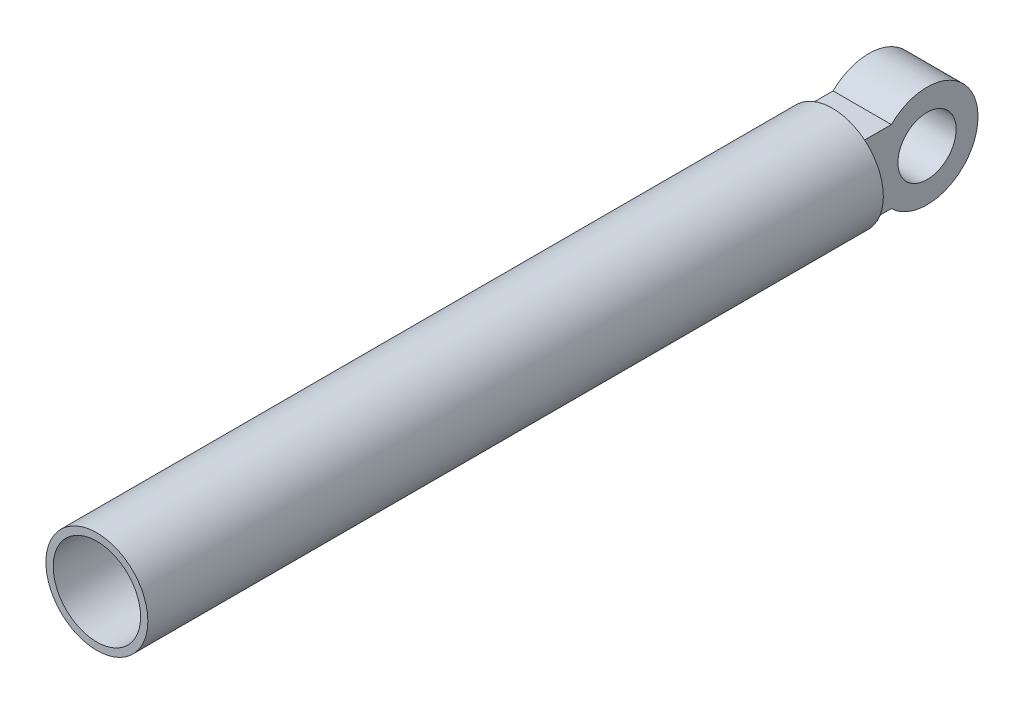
ISO-10303-21;
HEADER;
FILE_DESCRIPTION(('STEP AP214'),'2;1');
FILE_NAME('part.step','',(''),(''),'','','');
FILE_SCHEMA(('AUTOMOTIVE_DESIGN { 1 0 10303 214 1 1 1 1 }'));
ENDSEC;
DATA;
#1=APPLICATION_CONTEXT('core data for automotive mechanical design processes');
#2=APPLICATION_PROTOCOL_DEFINITION('international standard','automotive_design',2000,#1);
#3=PRODUCT_CONTEXT('',#1,'mechanical');
#4=PRODUCT('Part','Part','',(#3));
#5=PRODUCT_RELATED_PRODUCT_CATEGORY('part','',(#4));
#6=PRODUCT_DEFINITION_FORMATION('','',#4);
#7=PRODUCT_DEFINITION_CONTEXT('part definition',#1,'design');
#8=PRODUCT_DEFINITION('design','',#6,#7);
#9=PRODUCT_DEFINITION_SHAPE('','',#8);
#10=(LENGTH_UNIT() NAMED_UNIT(*) SI_UNIT(.MILLI.,.METRE.));
#11=(NAMED_UNIT(*) PLANE_ANGLE_UNIT() SI_UNIT($,.RADIAN.));
#12=(NAMED_UNIT(*) SI_UNIT($,.STERADIAN.) SOLID_ANGLE_UNIT());
#13=UNCERTAINTY_MEASURE_WITH_UNIT(LENGTH_MEASURE(1.E-05),#10,'distance_accuracy_value','');
#14=(GEOMETRIC_REPRESENTATION_CONTEXT(3) GLOBAL_UNCERTAINTY_ASSIGNED_CONTEXT((#13)) GLOBAL_UNIT_ASSIGNED_CONTEXT((#10,
#11,#12)) REPRESENTATION_CONTEXT('',''));
#15=CARTESIAN_POINT('',(0.,0.,0.));
#16=DIRECTION('',(0.,0.,1.));
#17=DIRECTION('',(1.,0.,0.));
#18=AXIS2_PLACEMENT_3D('',#15,#16,#17);
#19=CARTESIAN_POINT('',(0.,0.,-5.));
#20=DIRECTION('',(0.,0.,1.));
#21=DIRECTION('',(1.,0.,0.));
#22=AXIS2_PLACEMENT_3D('',#19,#20,#21);
#23=PLANE('',#22);
#24=CARTESIAN_POINT('',(0.,0.,-5.));
#25=DIRECTION('',(0.,0.,1.));
#26=DIRECTION('',(1.,0.,0.));
#27=AXIS2_PLACEMENT_3D('',#24,#25,#26);
#28=CIRCLE('',#27,35.);
#29=CARTESIAN_POINT('',(35.,0.,-5.));
#30=VERTEX_POINT('',#29);
#31=EDGE_CURVE('E39',#30,#30,#28,.T.);
#32=ORIENTED_EDGE('',*,*,#31,.F.);
#33=EDGE_LOOP('',(#32));
#34=FACE_BOUND('',#33,.T.);
#35=DIRECTION('',(-1.,0.,0.));
#36=VECTOR('',#35,1.);
#37=CARTESIAN_POINT('',(20.,-25.,-5.00000000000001));
#38=LINE('',#37,#36);
#39=CARTESIAN_POINT('',(20.,-25.,-5.));
#40=VERTEX_POINT('',#39);
#41=CARTESIAN_POINT('',(-20.,-25.,-5.));
#42=VERTEX_POINT('',#41);
#43=EDGE_CURVE('E46',#40,#42,#38,.T.);
#44=ORIENTED_EDGE('',*,*,#43,.F.);
#45=DIRECTION('',(0.,-1.,0.));
#46=VECTOR('',#45,1.);
#47=CARTESIAN_POINT('',(20.,25.,-5.00000000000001));
#48=LINE('',#47,#46);
#49=CARTESIAN_POINT('',(20.,25.,-5.00000000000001));
#50=VERTEX_POINT('',#49);
#51=EDGE_CURVE('E78',#50,#40,#48,.T.);
#52=ORIENTED_EDGE('',*,*,#51,.F.);
#53=DIRECTION('',(-1.,0.,0.));
#54=VECTOR('',#53,1.);
#55=CARTESIAN_POINT('',(20.,25.,-5.00000000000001));
#56=LINE('',#55,#54);
#57=CARTESIAN_POINT('',(-20.,25.,-5.));
#58=VERTEX_POINT('',#57);
#59=EDGE_CURVE('E94',#50,#58,#56,.T.);
#60=ORIENTED_EDGE('',*,*,#59,.T.);
#61=DIRECTION('',(0.,-1.,0.));
#62=VECTOR('',#61,1.);
#63=CARTESIAN_POINT('',(-20.,25.,-5.00000000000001));
#64=LINE('',#63,#62);
#65=EDGE_CURVE('E51',#58,#42,#64,.T.);
#66=ORIENTED_EDGE('',*,*,#65,.T.);
#67=EDGE_LOOP('',(#44,#52,#60,#66));
#68=FACE_BOUND('',#67,.T.);
#69=ADVANCED_FACE('F32',(#34,#68),#23,.F.);
#70=CARTESIAN_POINT('',(0.,0.,500.));
#71=DIRECTION('',(0.,0.,-1.));
#72=DIRECTION('',(-1.,0.,0.));
#73=AXIS2_PLACEMENT_3D('',#70,#71,#72);
#74=CYLINDRICAL_SURFACE('',#73,35.);
#75=CARTESIAN_POINT('',(0.,0.,500.));
#76=DIRECTION('',(0.,0.,1.));
#77=DIRECTION('',(1.,0.,0.));
#78=AXIS2_PLACEMENT_3D('',#75,#76,#77);
#79=CIRCLE('',#78,35.);
#80=CARTESIAN_POINT('',(35.,0.,500.));
#81=VERTEX_POINT('',#80);
#82=EDGE_CURVE('E11',#81,#81,#79,.T.);
#83=ORIENTED_EDGE('',*,*,#82,.F.);
#84=EDGE_LOOP('',(#83));
#85=FACE_BOUND('',#84,.T.);
#86=ORIENTED_EDGE('',*,*,#31,.T.);
#87=EDGE_LOOP('',(#86));
#88=FACE_BOUND('',#87,.T.);
#89=ADVANCED_FACE('F117',(#85,#88),#74,.T.);
#90=CARTESIAN_POINT('',(0.,0.,500.));
#91=DIRECTION('',(0.,0.,1.));
#92=DIRECTION('',(1.,0.,0.));
#93=AXIS2_PLACEMENT_3D('',#90,#91,#92);
#94=PLANE('',#93);
#95=CARTESIAN_POINT('',(0.,0.,500.));
#96=DIRECTION('',(0.,0.,1.));
#97=DIRECTION('',(1.,0.,0.));
#98=AXIS2_PLACEMENT_3D('',#95,#96,#97);
#99=CIRCLE('',#98,30.);
#100=CARTESIAN_POINT('',(30.,0.,500.));
#101=VERTEX_POINT('',#100);
#102=EDGE_CURVE('E110',#101,#101,#99,.T.);
#103=ORIENTED_EDGE('',*,*,#102,.F.);
#104=EDGE_LOOP('',(#103));
#105=FACE_BOUND('',#104,.T.);
#106=ORIENTED_EDGE('',*,*,#82,.T.);
#107=EDGE_LOOP('',(#106));
#108=FACE_BOUND('',#107,.T.);
#109=ADVANCED_FACE('F123',(#105,#108),#94,.T.);
#110=CARTESIAN_POINT('',(0.,0.,500.));
#111=DIRECTION('',(0.,0.,-1.));
#112=DIRECTION('',(-1.,0.,0.));
#113=AXIS2_PLACEMENT_3D('',#110,#111,#112);
#114=CYLINDRICAL_SURFACE('',#113,30.);
#115=ORIENTED_EDGE('',*,*,#102,.T.);
#116=EDGE_LOOP('',(#115));
#117=FACE_BOUND('',#116,.T.);
#118=CARTESIAN_POINT('',(0.,0.,0.));
#119=DIRECTION('',(0.,0.,1.));
#120=DIRECTION('',(1.,0.,0.));
#121=AXIS2_PLACEMENT_3D('',#118,#119,#120);
#122=CIRCLE('',#121,30.);
#123=CARTESIAN_POINT('',(30.,0.,0.));
#124=VERTEX_POINT('',#123);
#125=EDGE_CURVE('E109',#124,#124,#122,.T.);
#126=ORIENTED_EDGE('',*,*,#125,.F.);
#127=EDGE_LOOP('',(#126));
#128=FACE_BOUND('',#127,.T.);
#129=ADVANCED_FACE('F128',(#117,#128),#114,.F.);
#130=CARTESIAN_POINT('',(0.,0.,0.));
#131=DIRECTION('',(0.,0.,1.));
#132=DIRECTION('',(1.,0.,0.));
#133=AXIS2_PLACEMENT_3D('',#130,#131,#132);
#134=PLANE('',#133);
#135=ORIENTED_EDGE('',*,*,#125,.T.);
#136=EDGE_LOOP('',(#135));
#137=FACE_BOUND('',#136,.T.);
#138=ADVANCED_FACE('F135',(#137),#134,.T.);
#139=CARTESIAN_POINT('',(20.,0.,-50.));
#140=DIRECTION('',(1.,0.,0.));
#141=DIRECTION('',(0.,0.,-1.));
#142=AXIS2_PLACEMENT_3D('',#139,#140,#141);
#143=PLANE('',#142);
#144=ORIENTED_EDGE('',*,*,#51,.T.);
#145=DIRECTION('',(0.,0.,-1.));
#146=VECTOR('',#145,1.);
#147=CARTESIAN_POINT('',(20.,-25.,-5.00000000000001));
#148=LINE('',#147,#146);
#149=CARTESIAN_POINT('',(20.,-25.,-25.5051025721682));
#150=VERTEX_POINT('',#149);
#151=EDGE_CURVE('E70',#40,#150,#148,.T.);
#152=ORIENTED_EDGE('',*,*,#151,.T.);
#153=CARTESIAN_POINT('',(20.,0.,-50.));
#154=DIRECTION('',(1.,0.,0.));
#155=DIRECTION('',(0.,0.,-1.));
#156=AXIS2_PLACEMENT_3D('',#153,#154,#155);
#157=CIRCLE('',#156,35.);
#158=CARTESIAN_POINT('',(20.,25.,-25.5051025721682));
#159=VERTEX_POINT('',#158);
#160=EDGE_CURVE('E76',#150,#159,#157,.T.);
#161=ORIENTED_EDGE('',*,*,#160,.T.);
#162=DIRECTION('',(0.,0.,1.));
#163=VECTOR('',#162,1.);
#164=CARTESIAN_POINT('',(20.,25.,-5.00000000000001));
#165=LINE('',#164,#163);
#166=EDGE_CURVE('E92',#159,#50,#165,.T.);
#167=ORIENTED_EDGE('',*,*,#166,.T.);
#168=EDGE_LOOP('',(#144,#152,#161,#167));
#169=FACE_BOUND('',#168,.T.);
#170=CARTESIAN_POINT('',(20.,0.,-50.));
#171=DIRECTION('',(1.,0.,0.));
#172=DIRECTION('',(0.,0.,-1.));
#173=AXIS2_PLACEMENT_3D('',#170,#171,#172);
#174=CIRCLE('',#173,20.);
#175=CARTESIAN_POINT('',(20.,0.,-70.));
#176=VERTEX_POINT('',#175);
#177=EDGE_CURVE('E99',#176,#176,#174,.T.);
#178=ORIENTED_EDGE('',*,*,#177,.F.);
#179=EDGE_LOOP('',(#178));
#180=FACE_BOUND('',#179,.T.);
#181=ADVANCED_FACE('F72',(#169,#180),#143,.T.);
#182=CARTESIAN_POINT('',(-20.,0.,-50.));
#183=DIRECTION('',(1.,0.,0.));
#184=DIRECTION('',(0.,0.,-1.));
#185=AXIS2_PLACEMENT_3D('',#182,#183,#184);
#186=PLANE('',#185);
#187=ORIENTED_EDGE('',*,*,#65,.F.);
#188=DIRECTION('',(0.,0.,1.));
#189=VECTOR('',#188,1.);
#190=CARTESIAN_POINT('',(-20.,25.,-5.00000000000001));
#191=LINE('',#190,#189);
#192=CARTESIAN_POINT('',(-20.,25.,-25.5051025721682));
#193=VERTEX_POINT('',#192);
#194=EDGE_CURVE('E103',#193,#58,#191,.T.);
#195=ORIENTED_EDGE('',*,*,#194,.F.);
#196=CARTESIAN_POINT('',(-20.,0.,-50.));
#197=DIRECTION('',(1.,0.,0.));
#198=DIRECTION('',(0.,0.,-1.));
#199=AXIS2_PLACEMENT_3D('',#196,#197,#198);
#200=CIRCLE('',#199,35.);
#201=CARTESIAN_POINT('',(-20.,-25.,-25.5051025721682));
#202=VERTEX_POINT('',#201);
#203=EDGE_CURVE('E101',#202,#193,#200,.T.);
#204=ORIENTED_EDGE('',*,*,#203,.F.);
#205=DIRECTION('',(0.,0.,-1.));
#206=VECTOR('',#205,1.);
#207=CARTESIAN_POINT('',(-20.,-25.,-5.00000000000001));
#208=LINE('',#207,#206);
#209=EDGE_CURVE('E84',#42,#202,#208,.T.);
#210=ORIENTED_EDGE('',*,*,#209,.F.);
#211=EDGE_LOOP('',(#187,#195,#204,#210));
#212=FACE_BOUND('',#211,.T.);
#213=CARTESIAN_POINT('',(-20.,0.,-50.));
#214=DIRECTION('',(1.,0.,0.));
#215=DIRECTION('',(0.,0.,-1.));
#216=AXIS2_PLACEMENT_3D('',#213,#214,#215);
#217=CIRCLE('',#216,20.);
#218=CARTESIAN_POINT('',(-20.,0.,-70.));
#219=VERTEX_POINT('',#218);
#220=EDGE_CURVE('E164',#219,#219,#217,.T.);
#221=ORIENTED_EDGE('',*,*,#220,.T.);
#222=EDGE_LOOP('',(#221));
#223=FACE_BOUND('',#222,.T.);
#224=ADVANCED_FACE('F142',(#212,#223),#186,.F.);
#225=CARTESIAN_POINT('',(20.,-25.,-5.00000000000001));
#226=DIRECTION('',(0.,1.,0.));
#227=DIRECTION('',(0.,0.,1.));
#228=AXIS2_PLACEMENT_3D('',#225,#226,#227);
#229=PLANE('',#228);
#230=ORIENTED_EDGE('',*,*,#209,.T.);
#231=DIRECTION('',(-1.,0.,0.));
#232=VECTOR('',#231,1.);
#233=CARTESIAN_POINT('',(20.,-25.,-25.5051025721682));
#234=LINE('',#233,#232);
#235=EDGE_CURVE('E82',#150,#202,#234,.T.);
#236=ORIENTED_EDGE('',*,*,#235,.F.);
#237=ORIENTED_EDGE('',*,*,#151,.F.);
#238=ORIENTED_EDGE('',*,*,#43,.T.);
#239=EDGE_LOOP('',(#230,#236,#237,#238));
#240=FACE_BOUND('',#239,.T.);
#241=ADVANCED_FACE('F83',(#240),#229,.F.);
#242=CARTESIAN_POINT('',(20.,0.,-50.));
#243=DIRECTION('',(-1.,0.,0.));
#244=DIRECTION('',(0.,0.,1.));
#245=AXIS2_PLACEMENT_3D('',#242,#243,#244);
#246=CYLINDRICAL_SURFACE('',#245,35.);
#247=ORIENTED_EDGE('',*,*,#203,.T.);
#248=DIRECTION('',(-1.,0.,0.));
#249=VECTOR('',#248,1.);
#250=CARTESIAN_POINT('',(20.,25.,-25.5051025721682));
#251=LINE('',#250,#249);
#252=EDGE_CURVE('E87',#159,#193,#251,.T.);
#253=ORIENTED_EDGE('',*,*,#252,.F.);
#254=ORIENTED_EDGE('',*,*,#160,.F.);
#255=ORIENTED_EDGE('',*,*,#235,.T.);
#256=EDGE_LOOP('',(#247,#253,#254,#255));
#257=FACE_BOUND('',#256,.T.);
#258=ADVANCED_FACE('F89',(#257),#246,.T.);
#259=CARTESIAN_POINT('',(20.,25.,-5.00000000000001));
#260=DIRECTION('',(0.,-1.,0.));
#261=DIRECTION('',(0.,0.,-1.));
#262=AXIS2_PLACEMENT_3D('',#259,#260,#261);
#263=PLANE('',#262);
#264=ORIENTED_EDGE('',*,*,#194,.T.);
#265=ORIENTED_EDGE('',*,*,#59,.F.);
#266=ORIENTED_EDGE('',*,*,#166,.F.);
#267=ORIENTED_EDGE('',*,*,#252,.T.);
#268=EDGE_LOOP('',(#264,#265,#266,#267));
#269=FACE_BOUND('',#268,.T.);
#270=ADVANCED_FACE('F145',(#269),#263,.F.);
#271=CARTESIAN_POINT('',(20.,0.,-50.));
#272=DIRECTION('',(-1.,0.,0.));
#273=DIRECTION('',(0.,0.,1.));
#274=AXIS2_PLACEMENT_3D('',#271,#272,#273);
#275=CYLINDRICAL_SURFACE('',#274,20.);
#276=ORIENTED_EDGE('',*,*,#177,.T.);
#277=EDGE_LOOP('',(#276));
#278=FACE_BOUND('',#277,.T.);
#279=ORIENTED_EDGE('',*,*,#220,.F.);
#280=EDGE_LOOP('',(#279));
#281=FACE_BOUND('',#280,.T.);
#282=ADVANCED_FACE('F148',(#278,#281),#275,.F.);
#283=CLOSED_SHELL('',(#69,#89,#109,#129,#138,#181,#224,#241,#258,#270,#282));
#284=MANIFOLD_SOLID_BREP('B2',#283);
#285=ADVANCED_BREP_SHAPE_REPRESENTATION('',(#18,#284),#14);
#286=SHAPE_DEFINITION_REPRESENTATION(#9,#285);
ENDSEC;
END-ISO-10303-21;
